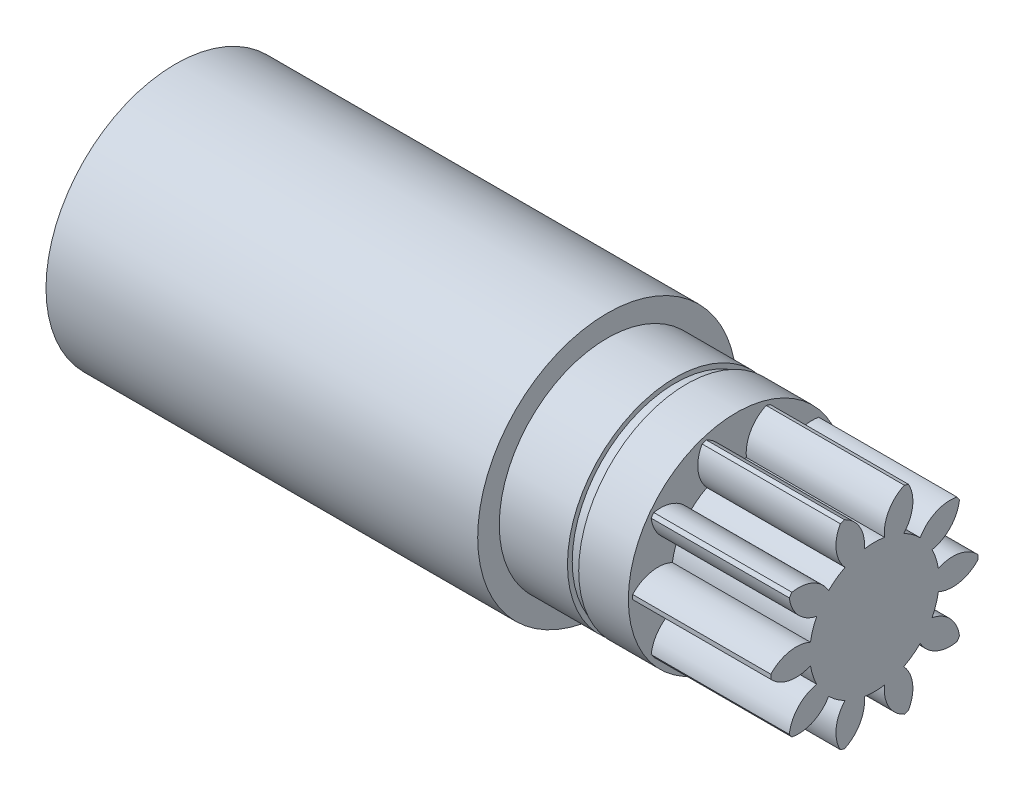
from build123d import *

# Parameters (mm, degrees)
BASPROSKE_W      = 16
BASPROSKE_H      = 12
TOOTHCUT_DEPTH   = 24.323807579
TEETHCUTS_COUNT  = 10
TEETHCUTS_ANGLE  = 324
BORSKE_R         = 7.4736
BORE_DEPTH       = 50.0000508
EXTRUSION2_START = -16
ESQUISSE1_R      = 7.499
EXTRUSION2_DEPTH = 16
ESQUISSE2_R      = 12.5
EXTRUSION3_DEPTH = 5.75
ESQUISSE3_R      = 11.95
EXTRUSION4_DEPTH = 1.3
ESQUISSE4_R      = 12.5
EXTRUSION5_DEPTH = 7.9
ESQUISSE5_R      = 15
EXTRUSION6_DEPTH = 50


with BuildPart() as part:
    # BasProSke → Base-Revolve (revolve)
    with BuildSketch(Plane(origin=(0, 0, 0), x_dir=(1, 0, 0), z_dir=(0, 1, 0)), mode=Mode.PRIVATE) as base_revolve_sk:
        with Locations((8, 6)):
            Rectangle(BASPROSKE_W, BASPROSKE_H)
    revolve(base_revolve_sk.sketch.rotate(Axis((-10, 0, 0), (1, 0, 0)), 180), axis=Axis((-10, 0, 0), (1, 0, 0)))

    # TooCutSke → ToothCut (cut, through all)
    with BuildSketch(Plane(origin=(0, 0, 0), x_dir=(0, 0, -1), z_dir=(1, 0, 0))):
        with BuildLine():
            ThreePointArc((1.173662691, 7.406586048), (0, 7.499), (-1.173662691, 7.406586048))
            ThreePointArc((-1.173662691, 7.406586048), (-1.668191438, 9.834565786), (-3.497907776, 11.50542856))
            ThreePointArc((-3.497907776, 11.50542856), (0, 12.0254), (3.497907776, 11.50542856))
            ThreePointArc((3.497907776, 11.50542856), (1.668191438, 9.834565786), (1.173662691, 7.406586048))
        make_face()
    toothcut = extrude(amount=TOOTHCUT_DEPTH, mode=Mode.SUBTRACT)

    # TeethCuts: ToothCut ×10 about axis
    teethcuts_axis = Axis((-10, 0, 0), (1, 0, 0))
    for i in range(1, TEETHCUTS_COUNT):
        add(toothcut.rotate(teethcuts_axis, i * TEETHCUTS_ANGLE / (TEETHCUTS_COUNT - 1)), mode=Mode.SUBTRACT)

    # BorSke → Bore (cut, symmetric)
    with BuildSketch(Plane(origin=(0, 0, 0), x_dir=(0, 0, -1), z_dir=(1, 0, 0))):
        with Locations(Location((0, 0, 0), (0, 0, 180))):
            Circle(BORSKE_R)
    extrude(amount=BORE_DEPTH, both=True, mode=Mode.SUBTRACT)

    # Esquisse1 → Extrusion2 (add)
    with BuildSketch(Plane(origin=(16, 0, 0), x_dir=(0, 0, -1), z_dir=(1, 0, 0)).offset(EXTRUSION2_START)):
        Circle(ESQUISSE1_R)
    extrude(amount=EXTRUSION2_DEPTH)

    # Esquisse2 → Extrusion3 (add)
    with BuildSketch(Plane.ZY):
        Circle(ESQUISSE2_R)
    extrude(amount=EXTRUSION3_DEPTH)

    # Esquisse3 → Extrusion4 (add)
    with BuildSketch(Plane.ZY.offset(5.75)):
        Circle(ESQUISSE3_R)
    extrude(amount=EXTRUSION4_DEPTH)

    # Esquisse4 → Extrusion5 (add)
    with BuildSketch(Plane.ZY.offset(7.05)):
        Circle(ESQUISSE4_R)
    extrude(amount=EXTRUSION5_DEPTH)

    # Esquisse5 → Extrusion6 (add)
    with BuildSketch(Plane.ZY.offset(14.95)):
        Circle(ESQUISSE5_R)
    extrude(amount=EXTRUSION6_DEPTH)


solid = part.part
